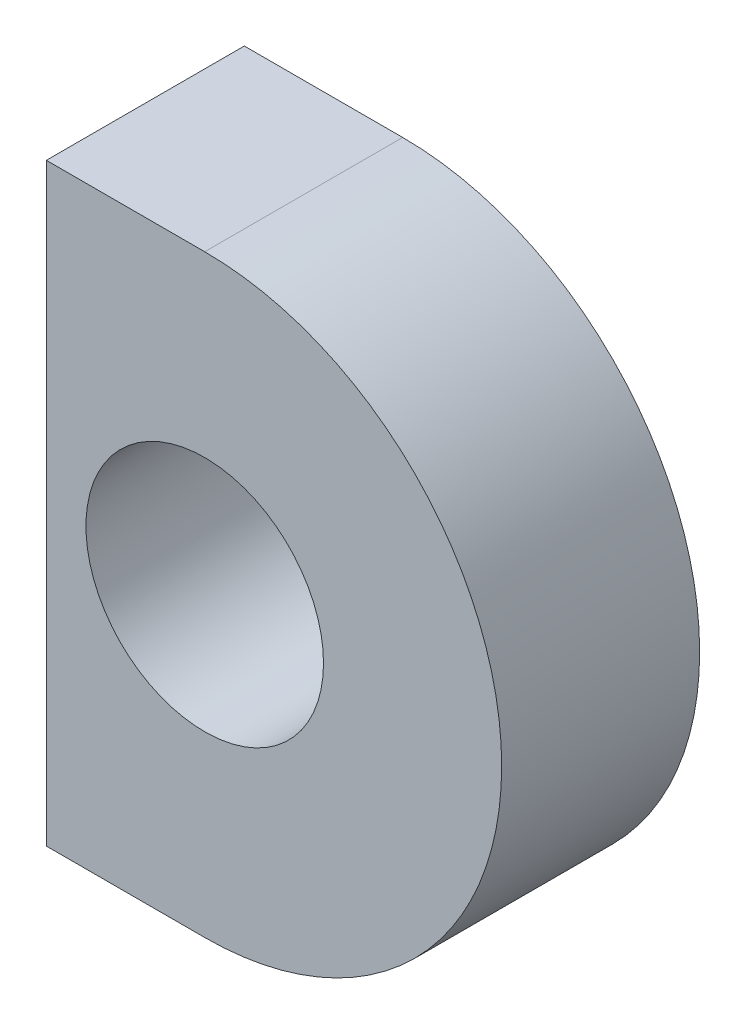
from build123d import *

# Parameters (mm, degrees)
EXTRUSION1_DEPTH        = 10
ESQUISSE2_R             = 6
ENL_V_MAT_EXTRU_1_DEPTH = 10
CHANFREIN1_SIZE         = 2
CHANFREIN2_SIZE         = 2


with BuildPart() as part:
    # Esquisse1 → Extrusion1 (new body)
    with BuildSketch(Plane.XY):
        with BuildLine():
            Line((0, 0), (10, 0))
            ThreePointArc((10, 0), (25, -15), (10, -30))
            Line((10, -30), (0, -30))
            Line((0, -30), (0, 0))
        make_face()
    extrude(amount=EXTRUSION1_DEPTH)

    # Esquisse2 → Enl_v. mat.-Extru.1 (cut)
    with BuildSketch(Plane.XY.offset(10)):
        with Locations((10, -15)):
            Circle(ESQUISSE2_R)
    extrude(amount=-ENL_V_MAT_EXTRU_1_DEPTH, mode=Mode.SUBTRACT)

    # Chanfrein1
    chanfrein1_edges = [part.edges().sort_by_distance(p)[0] for p in [
        (0, -15, 10),
        (0, -15, 0),
    ]]
    chamfer(chanfrein1_edges, length=CHANFREIN1_SIZE)

    # Chanfrein2
    chanfrein2_edges = [part.edges().sort_by_distance(p)[0] for p in [
        (0, 0, 5),
    ]]
    chamfer(chanfrein2_edges, length=CHANFREIN2_SIZE)


solid = part.part
